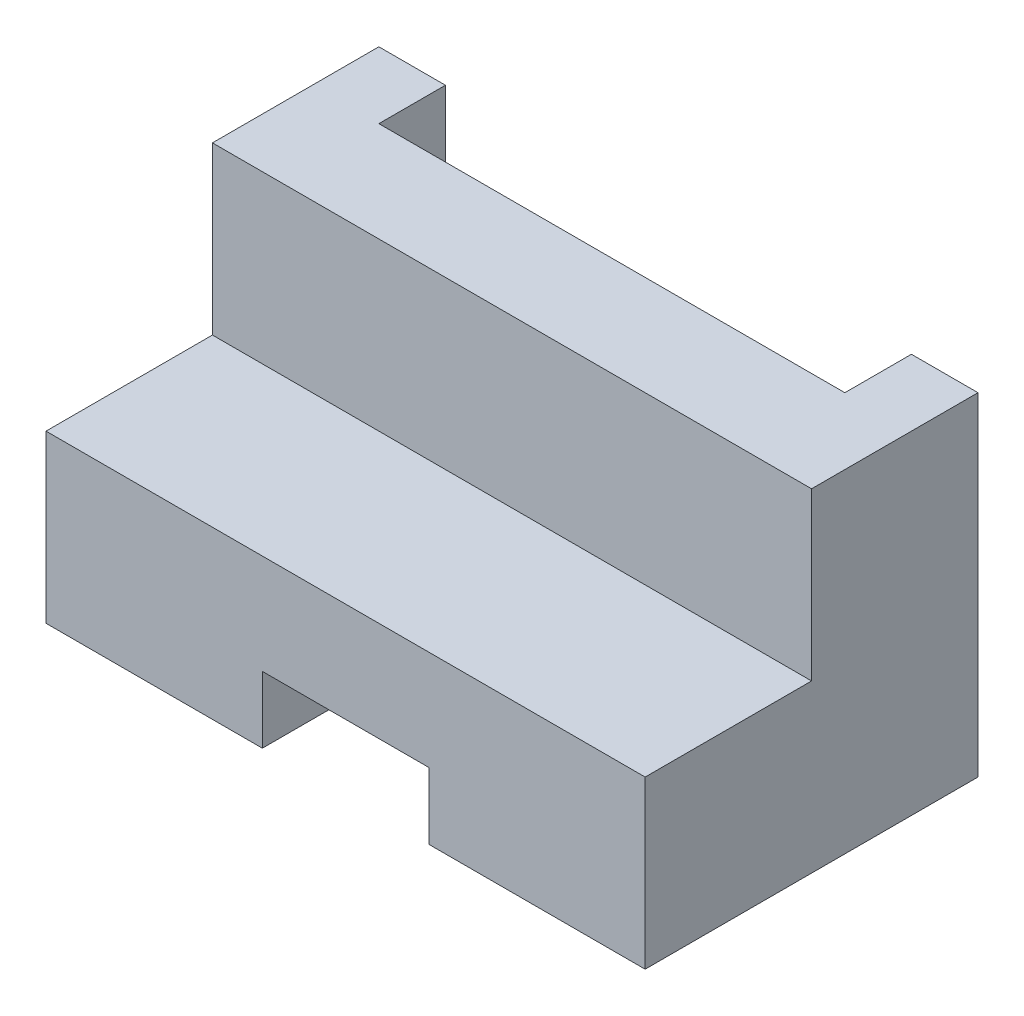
ISO-10303-21;
HEADER;
FILE_DESCRIPTION(('STEP AP214'),'2;1');
FILE_NAME('part.step','',(''),(''),'','','');
FILE_SCHEMA(('AUTOMOTIVE_DESIGN { 1 0 10303 214 1 1 1 1 }'));
ENDSEC;
DATA;
#1=APPLICATION_CONTEXT('core data for automotive mechanical design processes');
#2=APPLICATION_PROTOCOL_DEFINITION('international standard','automotive_design',2000,#1);
#3=PRODUCT_CONTEXT('',#1,'mechanical');
#4=PRODUCT('Part','Part','',(#3));
#5=PRODUCT_RELATED_PRODUCT_CATEGORY('part','',(#4));
#6=PRODUCT_DEFINITION_FORMATION('','',#4);
#7=PRODUCT_DEFINITION_CONTEXT('part definition',#1,'design');
#8=PRODUCT_DEFINITION('design','',#6,#7);
#9=PRODUCT_DEFINITION_SHAPE('','',#8);
#10=(LENGTH_UNIT() NAMED_UNIT(*) SI_UNIT(.MILLI.,.METRE.));
#11=(NAMED_UNIT(*) PLANE_ANGLE_UNIT() SI_UNIT($,.RADIAN.));
#12=(NAMED_UNIT(*) SI_UNIT($,.STERADIAN.) SOLID_ANGLE_UNIT());
#13=UNCERTAINTY_MEASURE_WITH_UNIT(LENGTH_MEASURE(1.E-05),#10,'distance_accuracy_value','');
#14=(GEOMETRIC_REPRESENTATION_CONTEXT(3) GLOBAL_UNCERTAINTY_ASSIGNED_CONTEXT((#13)) GLOBAL_UNIT_ASSIGNED_CONTEXT((#10,
#11,#12)) REPRESENTATION_CONTEXT('',''));
#15=CARTESIAN_POINT('',(0.,0.,0.));
#16=DIRECTION('',(0.,0.,1.));
#17=DIRECTION('',(1.,0.,0.));
#18=AXIS2_PLACEMENT_3D('',#15,#16,#17);
#19=CARTESIAN_POINT('',(0.,0.,-50.));
#20=DIRECTION('',(0.,-1.,0.));
#21=DIRECTION('',(0.,0.,-1.));
#22=AXIS2_PLACEMENT_3D('',#19,#20,#21);
#23=PLANE('',#22);
#24=DIRECTION('',(0.,0.,1.));
#25=VECTOR('',#24,1.);
#26=CARTESIAN_POINT('',(57.5,0.,-50.));
#27=LINE('',#26,#25);
#28=CARTESIAN_POINT('',(57.5,0.,-40.));
#29=VERTEX_POINT('',#28);
#30=CARTESIAN_POINT('',(57.5,0.,0.));
#31=VERTEX_POINT('',#30);
#32=EDGE_CURVE('E145',#29,#31,#27,.T.);
#33=ORIENTED_EDGE('',*,*,#32,.F.);
#34=DIRECTION('',(1.,0.,0.));
#35=VECTOR('',#34,1.);
#36=CARTESIAN_POINT('',(9.99999999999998,0.,-40.));
#37=LINE('',#36,#35);
#38=CARTESIAN_POINT('',(80.,0.,-40.));
#39=VERTEX_POINT('',#38);
#40=EDGE_CURVE('E162',#29,#39,#37,.T.);
#41=ORIENTED_EDGE('',*,*,#40,.T.);
#42=DIRECTION('',(0.,0.,-1.));
#43=VECTOR('',#42,1.);
#44=CARTESIAN_POINT('',(80.,0.,-50.));
#45=LINE('',#44,#43);
#46=CARTESIAN_POINT('',(80.,0.,-50.));
#47=VERTEX_POINT('',#46);
#48=EDGE_CURVE('E167',#39,#47,#45,.T.);
#49=ORIENTED_EDGE('',*,*,#48,.T.);
#50=DIRECTION('',(-1.,0.,0.));
#51=VECTOR('',#50,1.);
#52=CARTESIAN_POINT('',(0.,0.,-50.));
#53=LINE('',#52,#51);
#54=CARTESIAN_POINT('',(90.,0.,-50.));
#55=VERTEX_POINT('',#54);
#56=EDGE_CURVE('E253',#55,#47,#53,.T.);
#57=ORIENTED_EDGE('',*,*,#56,.F.);
#58=DIRECTION('',(0.,0.,-1.));
#59=VECTOR('',#58,1.);
#60=CARTESIAN_POINT('',(90.,0.,0.));
#61=LINE('',#60,#59);
#62=CARTESIAN_POINT('',(90.,0.,0.));
#63=VERTEX_POINT('',#62);
#64=EDGE_CURVE('E262',#63,#55,#61,.T.);
#65=ORIENTED_EDGE('',*,*,#64,.F.);
#66=DIRECTION('',(1.,0.,0.));
#67=VECTOR('',#66,1.);
#68=CARTESIAN_POINT('',(0.,0.,0.));
#69=LINE('',#68,#67);
#70=EDGE_CURVE('E279',#31,#63,#69,.T.);
#71=ORIENTED_EDGE('',*,*,#70,.F.);
#72=EDGE_LOOP('',(#33,#41,#49,#57,#65,#71));
#73=FACE_BOUND('',#72,.T.);
#74=ADVANCED_FACE('F31',(#73),#23,.T.);
#75=CARTESIAN_POINT('',(0.,25.,-50.));
#76=DIRECTION('',(0.,0.,1.));
#77=DIRECTION('',(1.,0.,0.));
#78=AXIS2_PLACEMENT_3D('',#75,#76,#77);
#79=PLANE('',#78);
#80=DIRECTION('',(-1.,0.,0.));
#81=VECTOR('',#80,1.);
#82=CARTESIAN_POINT('',(0.,50.,-50.));
#83=LINE('',#82,#81);
#84=CARTESIAN_POINT('',(9.99999999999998,50.,-50.));
#85=VERTEX_POINT('',#84);
#86=CARTESIAN_POINT('',(0.,50.,-50.));
#87=VERTEX_POINT('',#86);
#88=EDGE_CURVE('E193',#85,#87,#83,.T.);
#89=ORIENTED_EDGE('',*,*,#88,.F.);
#90=DIRECTION('',(0.,1.,0.));
#91=VECTOR('',#90,1.);
#92=CARTESIAN_POINT('',(9.99999999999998,0.,-50.));
#93=LINE('',#92,#91);
#94=CARTESIAN_POINT('',(9.99999999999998,0.,-50.));
#95=VERTEX_POINT('',#94);
#96=EDGE_CURVE('E176',#95,#85,#93,.T.);
#97=ORIENTED_EDGE('',*,*,#96,.F.);
#98=CARTESIAN_POINT('',(0.,0.,-50.));
#99=VERTEX_POINT('',#98);
#100=EDGE_CURVE('E230',#95,#99,#53,.T.);
#101=ORIENTED_EDGE('',*,*,#100,.T.);
#102=DIRECTION('',(0.,-1.,0.));
#103=VECTOR('',#102,1.);
#104=CARTESIAN_POINT('',(0.,25.,-50.));
#105=LINE('',#104,#103);
#106=EDGE_CURVE('E238',#87,#99,#105,.T.);
#107=ORIENTED_EDGE('',*,*,#106,.F.);
#108=EDGE_LOOP('',(#89,#97,#101,#107));
#109=FACE_BOUND('',#108,.T.);
#110=ADVANCED_FACE('F235',(#109),#79,.F.);
#111=CARTESIAN_POINT('',(0.,25.,-50.));
#112=DIRECTION('',(0.,-1.,0.));
#113=DIRECTION('',(0.,0.,-1.));
#114=AXIS2_PLACEMENT_3D('',#111,#112,#113);
#115=PLANE('',#114);
#116=DIRECTION('',(1.,0.,0.));
#117=VECTOR('',#116,1.);
#118=CARTESIAN_POINT('',(0.,25.,-25.));
#119=LINE('',#118,#117);
#120=CARTESIAN_POINT('',(0.,25.,-25.));
#121=VERTEX_POINT('',#120);
#122=CARTESIAN_POINT('',(90.,25.,-25.));
#123=VERTEX_POINT('',#122);
#124=EDGE_CURVE('E178',#121,#123,#119,.T.);
#125=ORIENTED_EDGE('',*,*,#124,.F.);
#126=DIRECTION('',(0.,0.,1.));
#127=VECTOR('',#126,1.);
#128=CARTESIAN_POINT('',(0.,25.,0.));
#129=LINE('',#128,#127);
#130=CARTESIAN_POINT('',(0.,25.,0.));
#131=VERTEX_POINT('',#130);
#132=EDGE_CURVE('E259',#121,#131,#129,.T.);
#133=ORIENTED_EDGE('',*,*,#132,.T.);
#134=DIRECTION('',(1.,0.,0.));
#135=VECTOR('',#134,1.);
#136=CARTESIAN_POINT('',(0.,25.,0.));
#137=LINE('',#136,#135);
#138=CARTESIAN_POINT('',(90.,25.,0.));
#139=VERTEX_POINT('',#138);
#140=EDGE_CURVE('E261',#131,#139,#137,.T.);
#141=ORIENTED_EDGE('',*,*,#140,.T.);
#142=DIRECTION('',(0.,0.,-1.));
#143=VECTOR('',#142,1.);
#144=CARTESIAN_POINT('',(90.,25.,0.));
#145=LINE('',#144,#143);
#146=EDGE_CURVE('E206',#139,#123,#145,.T.);
#147=ORIENTED_EDGE('',*,*,#146,.T.);
#148=EDGE_LOOP('',(#125,#133,#141,#147));
#149=FACE_BOUND('',#148,.T.);
#150=ADVANCED_FACE('F288',(#149),#115,.F.);
#151=CARTESIAN_POINT('',(0.,25.,0.));
#152=DIRECTION('',(1.,0.,0.));
#153=DIRECTION('',(0.,0.,-1.));
#154=AXIS2_PLACEMENT_3D('',#151,#152,#153);
#155=PLANE('',#154);
#156=DIRECTION('',(0.,0.,1.));
#157=VECTOR('',#156,1.);
#158=CARTESIAN_POINT('',(0.,0.,0.));
#159=LINE('',#158,#157);
#160=CARTESIAN_POINT('',(0.,0.,0.));
#161=VERTEX_POINT('',#160);
#162=EDGE_CURVE('E216',#99,#161,#159,.T.);
#163=ORIENTED_EDGE('',*,*,#162,.T.);
#164=DIRECTION('',(0.,-1.,0.));
#165=VECTOR('',#164,1.);
#166=CARTESIAN_POINT('',(0.,25.,0.));
#167=LINE('',#166,#165);
#168=EDGE_CURVE('E219',#131,#161,#167,.T.);
#169=ORIENTED_EDGE('',*,*,#168,.F.);
#170=ORIENTED_EDGE('',*,*,#132,.F.);
#171=DIRECTION('',(0.,-1.,0.));
#172=VECTOR('',#171,1.);
#173=CARTESIAN_POINT('',(0.,50.,-25.));
#174=LINE('',#173,#172);
#175=CARTESIAN_POINT('',(0.,50.,-25.));
#176=VERTEX_POINT('',#175);
#177=EDGE_CURVE('E211',#176,#121,#174,.T.);
#178=ORIENTED_EDGE('',*,*,#177,.F.);
#179=DIRECTION('',(0.,0.,1.));
#180=VECTOR('',#179,1.);
#181=CARTESIAN_POINT('',(0.,50.,-50.));
#182=LINE('',#181,#180);
#183=EDGE_CURVE('E185',#87,#176,#182,.T.);
#184=ORIENTED_EDGE('',*,*,#183,.F.);
#185=ORIENTED_EDGE('',*,*,#106,.T.);
#186=EDGE_LOOP('',(#163,#169,#170,#178,#184,#185));
#187=FACE_BOUND('',#186,.T.);
#188=ADVANCED_FACE('F33',(#187),#155,.F.);
#189=CARTESIAN_POINT('',(0.,25.,0.));
#190=DIRECTION('',(0.,0.,-1.));
#191=DIRECTION('',(-1.,0.,0.));
#192=AXIS2_PLACEMENT_3D('',#189,#190,#191);
#193=PLANE('',#192);
#194=DIRECTION('',(-1.,0.,0.));
#195=VECTOR('',#194,1.);
#196=CARTESIAN_POINT('',(57.5,10.,0.));
#197=LINE('',#196,#195);
#198=CARTESIAN_POINT('',(57.5,10.,0.));
#199=VERTEX_POINT('',#198);
#200=CARTESIAN_POINT('',(32.5,10.,0.));
#201=VERTEX_POINT('',#200);
#202=EDGE_CURVE('E134',#199,#201,#197,.T.);
#203=ORIENTED_EDGE('',*,*,#202,.F.);
#204=DIRECTION('',(0.,1.,0.));
#205=VECTOR('',#204,1.);
#206=CARTESIAN_POINT('',(57.5,0.,0.));
#207=LINE('',#206,#205);
#208=EDGE_CURVE('E142',#31,#199,#207,.T.);
#209=ORIENTED_EDGE('',*,*,#208,.F.);
#210=ORIENTED_EDGE('',*,*,#70,.T.);
#211=DIRECTION('',(0.,-1.,0.));
#212=VECTOR('',#211,1.);
#213=CARTESIAN_POINT('',(90.,25.,0.));
#214=LINE('',#213,#212);
#215=EDGE_CURVE('E268',#139,#63,#214,.T.);
#216=ORIENTED_EDGE('',*,*,#215,.F.);
#217=ORIENTED_EDGE('',*,*,#140,.F.);
#218=ORIENTED_EDGE('',*,*,#168,.T.);
#219=CARTESIAN_POINT('',(32.5,0.,0.));
#220=VERTEX_POINT('',#219);
#221=EDGE_CURVE('E275',#161,#220,#69,.T.);
#222=ORIENTED_EDGE('',*,*,#221,.T.);
#223=DIRECTION('',(0.,-1.,0.));
#224=VECTOR('',#223,1.);
#225=CARTESIAN_POINT('',(32.5,0.,0.));
#226=LINE('',#225,#224);
#227=EDGE_CURVE('E139',#201,#220,#226,.T.);
#228=ORIENTED_EDGE('',*,*,#227,.F.);
#229=EDGE_LOOP('',(#203,#209,#210,#216,#217,#218,#222,#228));
#230=FACE_BOUND('',#229,.T.);
#231=ADVANCED_FACE('F149',(#230),#193,.F.);
#232=CARTESIAN_POINT('',(90.,25.,0.));
#233=DIRECTION('',(-1.,0.,0.));
#234=DIRECTION('',(0.,0.,1.));
#235=AXIS2_PLACEMENT_3D('',#232,#233,#234);
#236=PLANE('',#235);
#237=ORIENTED_EDGE('',*,*,#64,.T.);
#238=DIRECTION('',(0.,-1.,0.));
#239=VECTOR('',#238,1.);
#240=CARTESIAN_POINT('',(90.,25.,-50.));
#241=LINE('',#240,#239);
#242=CARTESIAN_POINT('',(90.,50.,-50.));
#243=VERTEX_POINT('',#242);
#244=EDGE_CURVE('E258',#243,#55,#241,.T.);
#245=ORIENTED_EDGE('',*,*,#244,.F.);
#246=DIRECTION('',(0.,0.,-1.));
#247=VECTOR('',#246,1.);
#248=CARTESIAN_POINT('',(90.,50.,-50.));
#249=LINE('',#248,#247);
#250=CARTESIAN_POINT('',(90.,50.,-25.));
#251=VERTEX_POINT('',#250);
#252=EDGE_CURVE('E190',#251,#243,#249,.T.);
#253=ORIENTED_EDGE('',*,*,#252,.F.);
#254=DIRECTION('',(0.,-1.,0.));
#255=VECTOR('',#254,1.);
#256=CARTESIAN_POINT('',(90.,50.,-25.));
#257=LINE('',#256,#255);
#258=EDGE_CURVE('E197',#251,#123,#257,.T.);
#259=ORIENTED_EDGE('',*,*,#258,.T.);
#260=ORIENTED_EDGE('',*,*,#146,.F.);
#261=ORIENTED_EDGE('',*,*,#215,.T.);
#262=EDGE_LOOP('',(#237,#245,#253,#259,#260,#261));
#263=FACE_BOUND('',#262,.T.);
#264=ADVANCED_FACE('F283',(#263),#236,.F.);
#265=ORIENTED_EDGE('',*,*,#56,.T.);
#266=DIRECTION('',(0.,1.,0.));
#267=VECTOR('',#266,1.);
#268=CARTESIAN_POINT('',(80.,0.,-50.));
#269=LINE('',#268,#267);
#270=CARTESIAN_POINT('',(80.,50.,-50.));
#271=VERTEX_POINT('',#270);
#272=EDGE_CURVE('E179',#47,#271,#269,.T.);
#273=ORIENTED_EDGE('',*,*,#272,.T.);
#274=EDGE_CURVE('E194',#243,#271,#83,.T.);
#275=ORIENTED_EDGE('',*,*,#274,.F.);
#276=ORIENTED_EDGE('',*,*,#244,.T.);
#277=EDGE_LOOP('',(#265,#273,#275,#276));
#278=FACE_BOUND('',#277,.T.);
#279=ADVANCED_FACE('F256',(#278),#79,.F.);
#280=DIRECTION('',(0.,0.,1.));
#281=VECTOR('',#280,1.);
#282=CARTESIAN_POINT('',(32.5,0.,-50.));
#283=LINE('',#282,#281);
#284=CARTESIAN_POINT('',(32.5,0.,-40.));
#285=VERTEX_POINT('',#284);
#286=EDGE_CURVE('E155',#285,#220,#283,.T.);
#287=ORIENTED_EDGE('',*,*,#286,.T.);
#288=ORIENTED_EDGE('',*,*,#221,.F.);
#289=ORIENTED_EDGE('',*,*,#162,.F.);
#290=ORIENTED_EDGE('',*,*,#100,.F.);
#291=DIRECTION('',(0.,0.,1.));
#292=VECTOR('',#291,1.);
#293=CARTESIAN_POINT('',(9.99999999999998,0.,-50.));
#294=LINE('',#293,#292);
#295=CARTESIAN_POINT('',(9.99999999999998,0.,-40.));
#296=VERTEX_POINT('',#295);
#297=EDGE_CURVE('E159',#95,#296,#294,.T.);
#298=ORIENTED_EDGE('',*,*,#297,.T.);
#299=EDGE_CURVE('E164',#296,#285,#37,.T.);
#300=ORIENTED_EDGE('',*,*,#299,.T.);
#301=EDGE_LOOP('',(#287,#288,#289,#290,#298,#300));
#302=FACE_BOUND('',#301,.T.);
#303=ADVANCED_FACE('F227',(#302),#23,.T.);
#304=CARTESIAN_POINT('',(0.,50.,-25.));
#305=DIRECTION('',(0.,0.,-1.));
#306=DIRECTION('',(-1.,0.,0.));
#307=AXIS2_PLACEMENT_3D('',#304,#305,#306);
#308=PLANE('',#307);
#309=ORIENTED_EDGE('',*,*,#124,.T.);
#310=ORIENTED_EDGE('',*,*,#258,.F.);
#311=DIRECTION('',(1.,0.,0.));
#312=VECTOR('',#311,1.);
#313=CARTESIAN_POINT('',(0.,50.,-25.));
#314=LINE('',#313,#312);
#315=EDGE_CURVE('E188',#176,#251,#314,.T.);
#316=ORIENTED_EDGE('',*,*,#315,.F.);
#317=ORIENTED_EDGE('',*,*,#177,.T.);
#318=EDGE_LOOP('',(#309,#310,#316,#317));
#319=FACE_BOUND('',#318,.T.);
#320=ADVANCED_FACE('F290',(#319),#308,.F.);
#321=CARTESIAN_POINT('',(0.,50.,-25.));
#322=DIRECTION('',(0.,1.,0.));
#323=DIRECTION('',(0.,0.,1.));
#324=AXIS2_PLACEMENT_3D('',#321,#322,#323);
#325=PLANE('',#324);
#326=DIRECTION('',(0.,0.,1.));
#327=VECTOR('',#326,1.);
#328=CARTESIAN_POINT('',(9.99999999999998,50.,-50.));
#329=LINE('',#328,#327);
#330=CARTESIAN_POINT('',(9.99999999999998,50.,-40.));
#331=VERTEX_POINT('',#330);
#332=EDGE_CURVE('E54',#85,#331,#329,.T.);
#333=ORIENTED_EDGE('',*,*,#332,.F.);
#334=ORIENTED_EDGE('',*,*,#88,.T.);
#335=ORIENTED_EDGE('',*,*,#183,.T.);
#336=ORIENTED_EDGE('',*,*,#315,.T.);
#337=ORIENTED_EDGE('',*,*,#252,.T.);
#338=ORIENTED_EDGE('',*,*,#274,.T.);
#339=DIRECTION('',(0.,0.,-1.));
#340=VECTOR('',#339,1.);
#341=CARTESIAN_POINT('',(80.,50.,-50.));
#342=LINE('',#341,#340);
#343=CARTESIAN_POINT('',(80.,50.,-40.));
#344=VERTEX_POINT('',#343);
#345=EDGE_CURVE('E163',#344,#271,#342,.T.);
#346=ORIENTED_EDGE('',*,*,#345,.F.);
#347=DIRECTION('',(1.,0.,0.));
#348=VECTOR('',#347,1.);
#349=CARTESIAN_POINT('',(9.99999999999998,50.,-40.));
#350=LINE('',#349,#348);
#351=EDGE_CURVE('E172',#331,#344,#350,.T.);
#352=ORIENTED_EDGE('',*,*,#351,.F.);
#353=EDGE_LOOP('',(#333,#334,#335,#336,#337,#338,#346,#352));
#354=FACE_BOUND('',#353,.T.);
#355=ADVANCED_FACE('F241',(#354),#325,.T.);
#356=CARTESIAN_POINT('',(9.99999999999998,0.,-50.));
#357=DIRECTION('',(-1.,0.,0.));
#358=DIRECTION('',(0.,0.,1.));
#359=AXIS2_PLACEMENT_3D('',#356,#357,#358);
#360=PLANE('',#359);
#361=ORIENTED_EDGE('',*,*,#332,.T.);
#362=DIRECTION('',(0.,1.,0.));
#363=VECTOR('',#362,1.);
#364=CARTESIAN_POINT('',(9.99999999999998,0.,-40.));
#365=LINE('',#364,#363);
#366=EDGE_CURVE('E170',#296,#331,#365,.T.);
#367=ORIENTED_EDGE('',*,*,#366,.F.);
#368=ORIENTED_EDGE('',*,*,#297,.F.);
#369=ORIENTED_EDGE('',*,*,#96,.T.);
#370=EDGE_LOOP('',(#361,#367,#368,#369));
#371=FACE_BOUND('',#370,.T.);
#372=ADVANCED_FACE('F232',(#371),#360,.F.);
#373=CARTESIAN_POINT('',(80.,0.,-50.));
#374=DIRECTION('',(1.,0.,0.));
#375=DIRECTION('',(0.,0.,-1.));
#376=AXIS2_PLACEMENT_3D('',#373,#374,#375);
#377=PLANE('',#376);
#378=ORIENTED_EDGE('',*,*,#345,.T.);
#379=ORIENTED_EDGE('',*,*,#272,.F.);
#380=ORIENTED_EDGE('',*,*,#48,.F.);
#381=DIRECTION('',(0.,1.,0.));
#382=VECTOR('',#381,1.);
#383=CARTESIAN_POINT('',(80.,0.,-40.));
#384=LINE('',#383,#382);
#385=EDGE_CURVE('E182',#39,#344,#384,.T.);
#386=ORIENTED_EDGE('',*,*,#385,.T.);
#387=EDGE_LOOP('',(#378,#379,#380,#386));
#388=FACE_BOUND('',#387,.T.);
#389=ADVANCED_FACE('F248',(#388),#377,.F.);
#390=CARTESIAN_POINT('',(9.99999999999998,0.,-40.));
#391=DIRECTION('',(0.,0.,1.));
#392=DIRECTION('',(1.,0.,0.));
#393=AXIS2_PLACEMENT_3D('',#390,#391,#392);
#394=PLANE('',#393);
#395=ORIENTED_EDGE('',*,*,#40,.F.);
#396=DIRECTION('',(0.,1.,0.));
#397=VECTOR('',#396,1.);
#398=CARTESIAN_POINT('',(57.5,0.,-40.));
#399=LINE('',#398,#397);
#400=CARTESIAN_POINT('',(57.5,10.,-40.));
#401=VERTEX_POINT('',#400);
#402=EDGE_CURVE('E11',#29,#401,#399,.T.);
#403=ORIENTED_EDGE('',*,*,#402,.T.);
#404=DIRECTION('',(-1.,0.,0.));
#405=VECTOR('',#404,1.);
#406=CARTESIAN_POINT('',(9.99999999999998,10.,-40.));
#407=LINE('',#406,#405);
#408=CARTESIAN_POINT('',(32.5,10.,-40.));
#409=VERTEX_POINT('',#408);
#410=EDGE_CURVE('E137',#401,#409,#407,.T.);
#411=ORIENTED_EDGE('',*,*,#410,.T.);
#412=DIRECTION('',(0.,-1.,0.));
#413=VECTOR('',#412,1.);
#414=CARTESIAN_POINT('',(32.5,0.,-40.));
#415=LINE('',#414,#413);
#416=EDGE_CURVE('E39',#409,#285,#415,.T.);
#417=ORIENTED_EDGE('',*,*,#416,.T.);
#418=ORIENTED_EDGE('',*,*,#299,.F.);
#419=ORIENTED_EDGE('',*,*,#366,.T.);
#420=ORIENTED_EDGE('',*,*,#351,.T.);
#421=ORIENTED_EDGE('',*,*,#385,.F.);
#422=EDGE_LOOP('',(#395,#403,#411,#417,#418,#419,#420,#421));
#423=FACE_BOUND('',#422,.T.);
#424=ADVANCED_FACE('F224',(#423),#394,.F.);
#425=CARTESIAN_POINT('',(57.5,0.,-50.));
#426=DIRECTION('',(1.,0.,0.));
#427=DIRECTION('',(0.,0.,-1.));
#428=AXIS2_PLACEMENT_3D('',#425,#426,#427);
#429=PLANE('',#428);
#430=ORIENTED_EDGE('',*,*,#32,.T.);
#431=ORIENTED_EDGE('',*,*,#208,.T.);
#432=DIRECTION('',(0.,0.,1.));
#433=VECTOR('',#432,1.);
#434=CARTESIAN_POINT('',(57.5,10.,-50.));
#435=LINE('',#434,#433);
#436=EDGE_CURVE('E130',#401,#199,#435,.T.);
#437=ORIENTED_EDGE('',*,*,#436,.F.);
#438=ORIENTED_EDGE('',*,*,#402,.F.);
#439=EDGE_LOOP('',(#430,#431,#437,#438));
#440=FACE_BOUND('',#439,.T.);
#441=ADVANCED_FACE('F143',(#440),#429,.F.);
#442=CARTESIAN_POINT('',(32.5,0.,-50.));
#443=DIRECTION('',(-1.,0.,0.));
#444=DIRECTION('',(0.,0.,1.));
#445=AXIS2_PLACEMENT_3D('',#442,#443,#444);
#446=PLANE('',#445);
#447=DIRECTION('',(0.,0.,1.));
#448=VECTOR('',#447,1.);
#449=CARTESIAN_POINT('',(32.5,10.,-50.));
#450=LINE('',#449,#448);
#451=EDGE_CURVE('E46',#409,#201,#450,.T.);
#452=ORIENTED_EDGE('',*,*,#451,.T.);
#453=ORIENTED_EDGE('',*,*,#227,.T.);
#454=ORIENTED_EDGE('',*,*,#286,.F.);
#455=ORIENTED_EDGE('',*,*,#416,.F.);
#456=EDGE_LOOP('',(#452,#453,#454,#455));
#457=FACE_BOUND('',#456,.T.);
#458=ADVANCED_FACE('F388',(#457),#446,.F.);
#459=CARTESIAN_POINT('',(57.5,10.,-50.));
#460=DIRECTION('',(0.,1.,0.));
#461=DIRECTION('',(-1.,0.,0.));
#462=AXIS2_PLACEMENT_3D('',#459,#460,#461);
#463=PLANE('',#462);
#464=ORIENTED_EDGE('',*,*,#436,.T.);
#465=ORIENTED_EDGE('',*,*,#202,.T.);
#466=ORIENTED_EDGE('',*,*,#451,.F.);
#467=ORIENTED_EDGE('',*,*,#410,.F.);
#468=EDGE_LOOP('',(#464,#465,#466,#467));
#469=FACE_BOUND('',#468,.T.);
#470=ADVANCED_FACE('F132',(#469),#463,.F.);
#471=CLOSED_SHELL('',(#74,#110,#150,#188,#231,#264,#279,#303,#320,#355,#372,#389,#424,#441,#458,#470));
#472=MANIFOLD_SOLID_BREP('B2',#471);
#473=ADVANCED_BREP_SHAPE_REPRESENTATION('',(#18,#472),#14);
#474=SHAPE_DEFINITION_REPRESENTATION(#9,#473);
ENDSEC;
END-ISO-10303-21;
